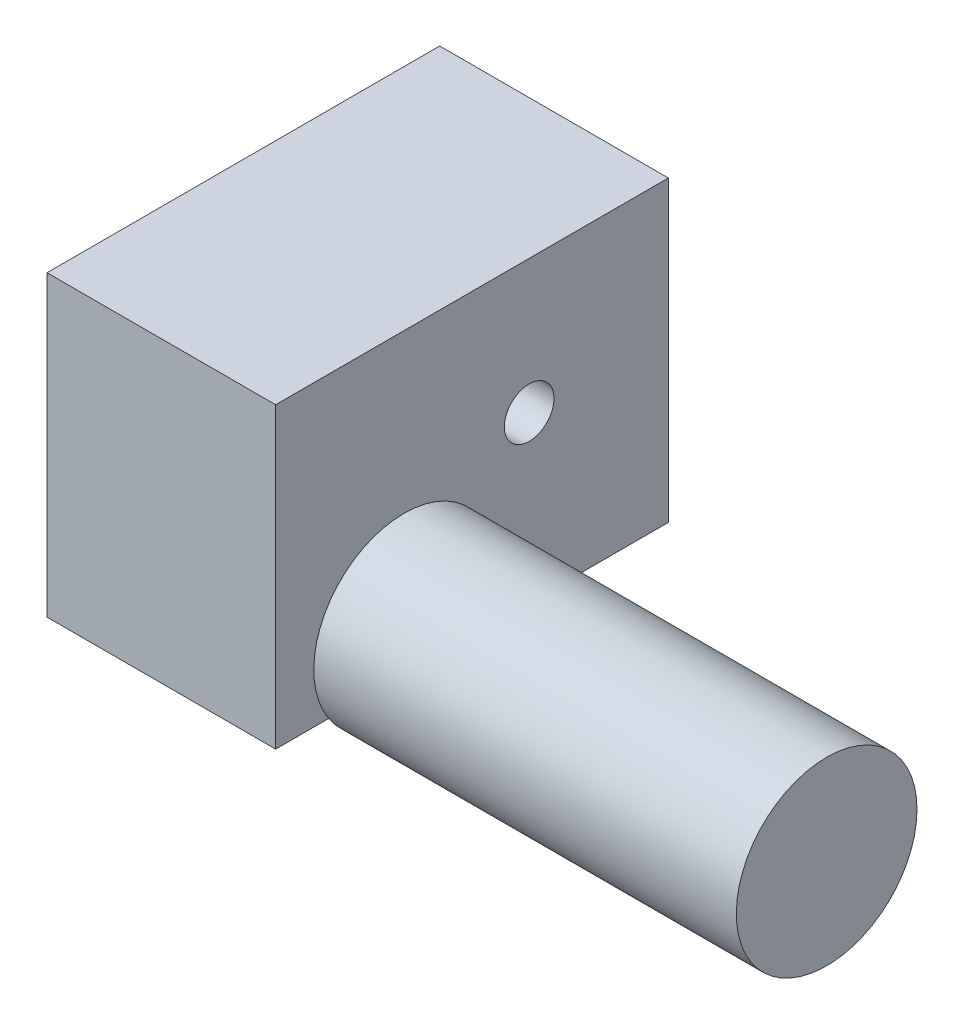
from build123d import *

# Parameters (mm, degrees)
SKETCH1_W           = 120
SKETCH1_H           = 158
BOSS_EXTRUDE1_DEPTH = 92
SKETCH2_R           = 36.35
BOSS_EXTRUDE2_DEPTH = 170
CUT_EXTRUDE1_START  = -120
SKETCH4_W           = 654.973605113
SKETCH4_H           = 428.305396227
CUT_EXTRUDE1_DEPTH  = 136.359941
SKETCH5_R           = 10
CUT_EXTRUDE2_DEPTH  = 270.180299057


with BuildPart() as part:
    # Sketch1 → Boss-Extrude1 (new body)
    with BuildSketch(Plane.YZ):
        with Locations((60, -79)):
            Rectangle(SKETCH1_W, SKETCH1_H)
    extrude(amount=BOSS_EXTRUDE1_DEPTH)

    # Sketch2 → Boss-Extrude2 (add)
    with BuildSketch(Plane.YZ.offset(92)):
        with Locations(Location((100.009940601, -51.689843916, 0), (0, 0, 56.63759311))):
            Circle(SKETCH2_R)
    extrude(amount=BOSS_EXTRUDE2_DEPTH)

    # Mirror1: part across plane


with BuildPart() as part_1:
    add(part.part)
    add(part.part.mirror(Plane.ZX))

    # Sketch4 → Cut-Extrude1 (cut)
    with BuildSketch(Plane(origin=(0, 120, 0), x_dir=(-1, 0, 0), z_dir=(0, 1, 0)).offset(CUT_EXTRUDE1_START)):
        with Locations((-61.746660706, -50.16309619)):
            Rectangle(SKETCH4_W, SKETCH4_H)
    extrude(amount=CUT_EXTRUDE1_DEPTH, mode=Mode.SUBTRACT)

    # Sketch5 → Cut-Extrude2 (cut, through all)
    with BuildSketch(Plane.YZ.offset(92)):
        with Locations(Location((-53.75, -102, 0), (0, 0, 270))):
            Circle(SKETCH5_R)
    extrude(amount=-CUT_EXTRUDE2_DEPTH, mode=Mode.SUBTRACT)


solid = part_1.part
